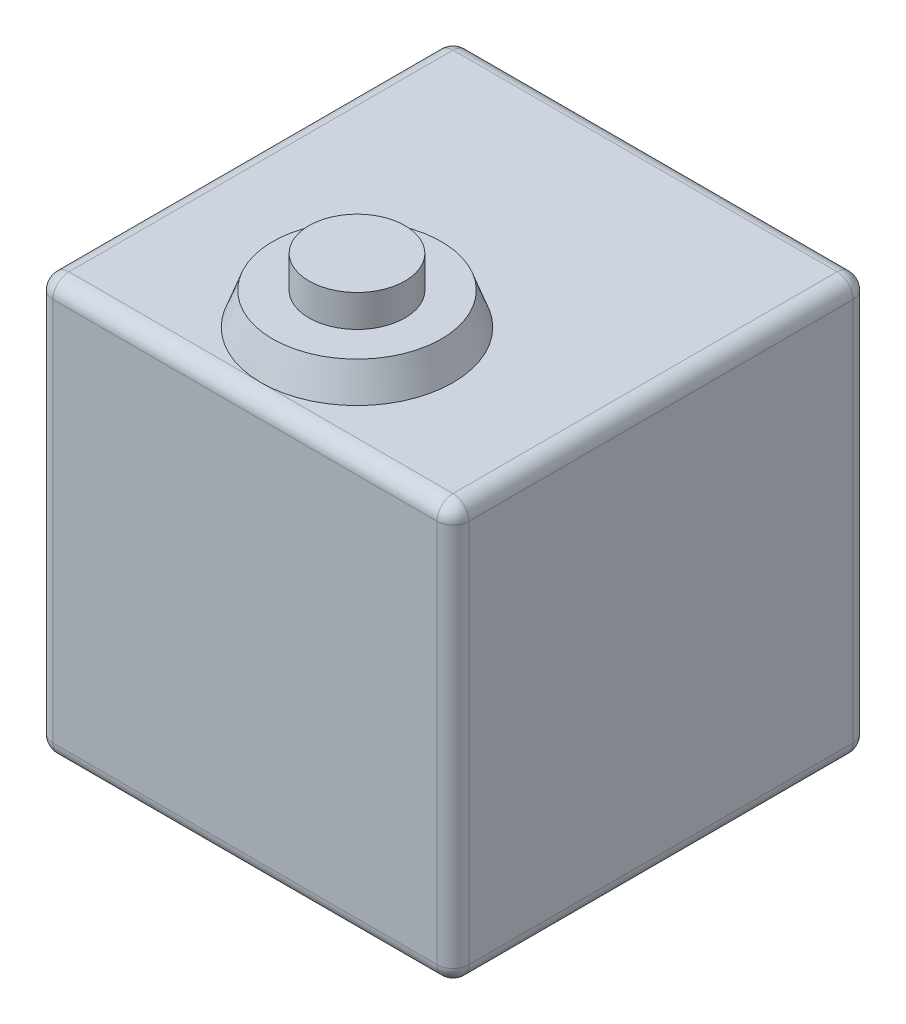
ISO-10303-21;
HEADER;
FILE_DESCRIPTION(('STEP AP214'),'2;1');
FILE_NAME('part.step','',(''),(''),'','','');
FILE_SCHEMA(('AUTOMOTIVE_DESIGN { 1 0 10303 214 1 1 1 1 }'));
ENDSEC;
DATA;
#1=APPLICATION_CONTEXT('core data for automotive mechanical design processes');
#2=APPLICATION_PROTOCOL_DEFINITION('international standard','automotive_design',2000,#1);
#3=PRODUCT_CONTEXT('',#1,'mechanical');
#4=PRODUCT('Part','Part','',(#3));
#5=PRODUCT_RELATED_PRODUCT_CATEGORY('part','',(#4));
#6=PRODUCT_DEFINITION_FORMATION('','',#4);
#7=PRODUCT_DEFINITION_CONTEXT('part definition',#1,'design');
#8=PRODUCT_DEFINITION('design','',#6,#7);
#9=PRODUCT_DEFINITION_SHAPE('','',#8);
#10=(LENGTH_UNIT() NAMED_UNIT(*) SI_UNIT(.MILLI.,.METRE.));
#11=(NAMED_UNIT(*) PLANE_ANGLE_UNIT() SI_UNIT($,.RADIAN.));
#12=(NAMED_UNIT(*) SI_UNIT($,.STERADIAN.) SOLID_ANGLE_UNIT());
#13=UNCERTAINTY_MEASURE_WITH_UNIT(LENGTH_MEASURE(1.E-05),#10,'distance_accuracy_value','');
#14=(GEOMETRIC_REPRESENTATION_CONTEXT(3) GLOBAL_UNCERTAINTY_ASSIGNED_CONTEXT((#13)) GLOBAL_UNIT_ASSIGNED_CONTEXT((#10,
#11,#12)) REPRESENTATION_CONTEXT('',''));
#15=CARTESIAN_POINT('',(0.,0.,0.));
#16=DIRECTION('',(0.,0.,1.));
#17=DIRECTION('',(1.,0.,0.));
#18=AXIS2_PLACEMENT_3D('',#15,#16,#17);
#19=CARTESIAN_POINT('',(82.55,165.1,82.55));
#20=DIRECTION('',(-1.,0.,0.));
#21=DIRECTION('',(0.,0.,1.));
#22=AXIS2_PLACEMENT_3D('',#19,#20,#21);
#23=PLANE('',#22);
#24=DIRECTION('',(0.,-1.,0.));
#25=VECTOR('',#24,1.);
#26=CARTESIAN_POINT('',(82.55,165.1,-76.2));
#27=LINE('',#26,#25);
#28=CARTESIAN_POINT('',(82.55,6.34999999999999,-76.2));
#29=VERTEX_POINT('',#28);
#30=CARTESIAN_POINT('',(82.55,158.75,-76.2));
#31=VERTEX_POINT('',#30);
#32=EDGE_CURVE('E221',#29,#31,#27,.F.);
#33=ORIENTED_EDGE('',*,*,#32,.T.);
#34=DIRECTION('',(0.,0.,-1.));
#35=VECTOR('',#34,1.);
#36=CARTESIAN_POINT('',(82.55,158.75,82.55));
#37=LINE('',#36,#35);
#38=CARTESIAN_POINT('',(82.55,158.75,76.2));
#39=VERTEX_POINT('',#38);
#40=EDGE_CURVE('E224',#31,#39,#37,.F.);
#41=ORIENTED_EDGE('',*,*,#40,.T.);
#42=DIRECTION('',(0.,-1.,0.));
#43=VECTOR('',#42,1.);
#44=CARTESIAN_POINT('',(82.55,165.1,76.2));
#45=LINE('',#44,#43);
#46=CARTESIAN_POINT('',(82.55,6.34999999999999,76.2));
#47=VERTEX_POINT('',#46);
#48=EDGE_CURVE('E215',#39,#47,#45,.T.);
#49=ORIENTED_EDGE('',*,*,#48,.T.);
#50=DIRECTION('',(0.,0.,-1.));
#51=VECTOR('',#50,1.);
#52=CARTESIAN_POINT('',(82.55,6.34999999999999,-82.55));
#53=LINE('',#52,#51);
#54=EDGE_CURVE('E218',#47,#29,#53,.T.);
#55=ORIENTED_EDGE('',*,*,#54,.T.);
#56=EDGE_LOOP('',(#33,#41,#49,#55));
#57=FACE_BOUND('',#56,.T.);
#58=ADVANCED_FACE('F47',(#57),#23,.F.);
#59=CARTESIAN_POINT('',(-82.55,165.1,-82.55));
#60=DIRECTION('',(0.,0.,1.));
#61=DIRECTION('',(1.,0.,0.));
#62=AXIS2_PLACEMENT_3D('',#59,#60,#61);
#63=PLANE('',#62);
#64=DIRECTION('',(-1.,0.,0.));
#65=VECTOR('',#64,1.);
#66=CARTESIAN_POINT('',(-82.55,6.34999999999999,-82.55));
#67=LINE('',#66,#65);
#68=CARTESIAN_POINT('',(76.2,6.34999999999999,-82.55));
#69=VERTEX_POINT('',#68);
#70=CARTESIAN_POINT('',(-76.2,6.34999999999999,-82.55));
#71=VERTEX_POINT('',#70);
#72=EDGE_CURVE('E179',#69,#71,#67,.T.);
#73=ORIENTED_EDGE('',*,*,#72,.T.);
#74=DIRECTION('',(0.,-1.,0.));
#75=VECTOR('',#74,1.);
#76=CARTESIAN_POINT('',(-76.2,165.1,-82.55));
#77=LINE('',#76,#75);
#78=CARTESIAN_POINT('',(-76.2,158.75,-82.55));
#79=VERTEX_POINT('',#78);
#80=EDGE_CURVE('E186',#71,#79,#77,.F.);
#81=ORIENTED_EDGE('',*,*,#80,.T.);
#82=DIRECTION('',(-1.,0.,0.));
#83=VECTOR('',#82,1.);
#84=CARTESIAN_POINT('',(-82.55,158.75,-82.55));
#85=LINE('',#84,#83);
#86=CARTESIAN_POINT('',(76.2,158.75,-82.55));
#87=VERTEX_POINT('',#86);
#88=EDGE_CURVE('E182',#79,#87,#85,.F.);
#89=ORIENTED_EDGE('',*,*,#88,.T.);
#90=DIRECTION('',(0.,-1.,0.));
#91=VECTOR('',#90,1.);
#92=CARTESIAN_POINT('',(76.2,165.1,-82.55));
#93=LINE('',#92,#91);
#94=EDGE_CURVE('E176',#87,#69,#93,.T.);
#95=ORIENTED_EDGE('',*,*,#94,.T.);
#96=EDGE_LOOP('',(#73,#81,#89,#95));
#97=FACE_BOUND('',#96,.T.);
#98=ADVANCED_FACE('F403',(#97),#63,.F.);
#99=CARTESIAN_POINT('',(-82.55,165.1,82.55));
#100=DIRECTION('',(1.,0.,0.));
#101=DIRECTION('',(0.,0.,-1.));
#102=AXIS2_PLACEMENT_3D('',#99,#100,#101);
#103=PLANE('',#102);
#104=DIRECTION('',(0.,0.,1.));
#105=VECTOR('',#104,1.);
#106=CARTESIAN_POINT('',(-82.55,158.75,82.55));
#107=LINE('',#106,#105);
#108=CARTESIAN_POINT('',(-82.55,158.75,76.2));
#109=VERTEX_POINT('',#108);
#110=CARTESIAN_POINT('',(-82.55,158.75,-76.2));
#111=VERTEX_POINT('',#110);
#112=EDGE_CURVE('E208',#109,#111,#107,.F.);
#113=ORIENTED_EDGE('',*,*,#112,.T.);
#114=DIRECTION('',(0.,-1.,0.));
#115=VECTOR('',#114,1.);
#116=CARTESIAN_POINT('',(-82.55,165.1,-76.2));
#117=LINE('',#116,#115);
#118=CARTESIAN_POINT('',(-82.55,6.34999999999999,-76.2));
#119=VERTEX_POINT('',#118);
#120=EDGE_CURVE('E211',#111,#119,#117,.T.);
#121=ORIENTED_EDGE('',*,*,#120,.T.);
#122=DIRECTION('',(0.,0.,1.));
#123=VECTOR('',#122,1.);
#124=CARTESIAN_POINT('',(-82.55,6.34999999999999,82.55));
#125=LINE('',#124,#123);
#126=CARTESIAN_POINT('',(-82.55,6.34999999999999,76.2));
#127=VERTEX_POINT('',#126);
#128=EDGE_CURVE('E205',#119,#127,#125,.T.);
#129=ORIENTED_EDGE('',*,*,#128,.T.);
#130=DIRECTION('',(0.,-1.,0.));
#131=VECTOR('',#130,1.);
#132=CARTESIAN_POINT('',(-82.55,165.1,76.2));
#133=LINE('',#132,#131);
#134=EDGE_CURVE('E202',#127,#109,#133,.F.);
#135=ORIENTED_EDGE('',*,*,#134,.T.);
#136=EDGE_LOOP('',(#113,#121,#129,#135));
#137=FACE_BOUND('',#136,.T.);
#138=ADVANCED_FACE('F343',(#137),#103,.F.);
#139=CARTESIAN_POINT('',(-82.55,165.1,82.55));
#140=DIRECTION('',(0.,0.,-1.));
#141=DIRECTION('',(-1.,0.,0.));
#142=AXIS2_PLACEMENT_3D('',#139,#140,#141);
#143=PLANE('',#142);
#144=DIRECTION('',(1.,0.,0.));
#145=VECTOR('',#144,1.);
#146=CARTESIAN_POINT('',(-82.55,158.75,82.55));
#147=LINE('',#146,#145);
#148=CARTESIAN_POINT('',(76.2,158.75,82.55));
#149=VERTEX_POINT('',#148);
#150=CARTESIAN_POINT('',(-76.2,158.75,82.55));
#151=VERTEX_POINT('',#150);
#152=EDGE_CURVE('E65',#149,#151,#147,.F.);
#153=ORIENTED_EDGE('',*,*,#152,.T.);
#154=DIRECTION('',(0.,-1.,0.));
#155=VECTOR('',#154,1.);
#156=CARTESIAN_POINT('',(-76.2,165.1,82.55));
#157=LINE('',#156,#155);
#158=CARTESIAN_POINT('',(-76.2,6.34999999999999,82.55));
#159=VERTEX_POINT('',#158);
#160=EDGE_CURVE('E57',#151,#159,#157,.T.);
#161=ORIENTED_EDGE('',*,*,#160,.T.);
#162=DIRECTION('',(1.,0.,0.));
#163=VECTOR('',#162,1.);
#164=CARTESIAN_POINT('',(82.55,6.34999999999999,82.55));
#165=LINE('',#164,#163);
#166=CARTESIAN_POINT('',(76.2,6.34999999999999,82.55));
#167=VERTEX_POINT('',#166);
#168=EDGE_CURVE('E228',#159,#167,#165,.T.);
#169=ORIENTED_EDGE('',*,*,#168,.T.);
#170=DIRECTION('',(0.,-1.,0.));
#171=VECTOR('',#170,1.);
#172=CARTESIAN_POINT('',(76.2,165.1,82.55));
#173=LINE('',#172,#171);
#174=EDGE_CURVE('E70',#167,#149,#173,.F.);
#175=ORIENTED_EDGE('',*,*,#174,.T.);
#176=EDGE_LOOP('',(#153,#161,#169,#175));
#177=FACE_BOUND('',#176,.T.);
#178=ADVANCED_FACE('F329',(#177),#143,.F.);
#179=CARTESIAN_POINT('',(0.,165.1,0.));
#180=DIRECTION('',(0.,-1.,0.));
#181=DIRECTION('',(0.,0.,-1.));
#182=AXIS2_PLACEMENT_3D('',#179,#180,#181);
#183=PLANE('',#182);
#184=DIRECTION('',(1.,0.,0.));
#185=VECTOR('',#184,1.);
#186=CARTESIAN_POINT('',(0.,165.1,76.2));
#187=LINE('',#186,#185);
#188=CARTESIAN_POINT('',(-76.2,165.1,76.2));
#189=VERTEX_POINT('',#188);
#190=CARTESIAN_POINT('',(0.,165.1,76.2));
#191=VERTEX_POINT('',#190);
#192=EDGE_CURVE('E141',#189,#191,#187,.T.);
#193=ORIENTED_EDGE('',*,*,#192,.T.);
#194=CARTESIAN_POINT('',(0.,165.1,38.1));
#195=DIRECTION('',(0.,1.,0.));
#196=DIRECTION('',(0.,0.,1.));
#197=AXIS2_PLACEMENT_3D('',#194,#195,#196);
#198=CIRCLE('',#197,38.1);
#199=EDGE_CURVE('E145',#191,#191,#198,.T.);
#200=ORIENTED_EDGE('',*,*,#199,.F.);
#201=CARTESIAN_POINT('',(76.2,165.1,76.2));
#202=VERTEX_POINT('',#201);
#203=EDGE_CURVE('E154',#191,#202,#187,.T.);
#204=ORIENTED_EDGE('',*,*,#203,.T.);
#205=DIRECTION('',(0.,0.,-1.));
#206=VECTOR('',#205,1.);
#207=CARTESIAN_POINT('',(76.2,165.1,0.));
#208=LINE('',#207,#206);
#209=CARTESIAN_POINT('',(76.2,165.1,-76.2));
#210=VERTEX_POINT('',#209);
#211=EDGE_CURVE('E153',#202,#210,#208,.T.);
#212=ORIENTED_EDGE('',*,*,#211,.T.);
#213=DIRECTION('',(-1.,0.,0.));
#214=VECTOR('',#213,1.);
#215=CARTESIAN_POINT('',(0.,165.1,-76.2));
#216=LINE('',#215,#214);
#217=CARTESIAN_POINT('',(-76.2,165.1,-76.2));
#218=VERTEX_POINT('',#217);
#219=EDGE_CURVE('E173',#210,#218,#216,.T.);
#220=ORIENTED_EDGE('',*,*,#219,.T.);
#221=DIRECTION('',(0.,0.,1.));
#222=VECTOR('',#221,1.);
#223=CARTESIAN_POINT('',(-76.2,165.1,0.));
#224=LINE('',#223,#222);
#225=EDGE_CURVE('E148',#218,#189,#224,.T.);
#226=ORIENTED_EDGE('',*,*,#225,.T.);
#227=EDGE_LOOP('',(#193,#200,#204,#212,#220,#226));
#228=FACE_BOUND('',#227,.T.);
#229=ADVANCED_FACE('F143',(#228),#183,.F.);
#230=CARTESIAN_POINT('',(0.,0.,0.));
#231=DIRECTION('',(0.,-1.,0.));
#232=DIRECTION('',(0.,0.,-1.));
#233=AXIS2_PLACEMENT_3D('',#230,#231,#232);
#234=PLANE('',#233);
#235=DIRECTION('',(0.,0.,1.));
#236=VECTOR('',#235,1.);
#237=CARTESIAN_POINT('',(-76.2,0.,-82.55));
#238=LINE('',#237,#236);
#239=CARTESIAN_POINT('',(-76.2,0.,76.2));
#240=VERTEX_POINT('',#239);
#241=CARTESIAN_POINT('',(-76.2,0.,-76.2));
#242=VERTEX_POINT('',#241);
#243=EDGE_CURVE('E195',#240,#242,#238,.F.);
#244=ORIENTED_EDGE('',*,*,#243,.T.);
#245=DIRECTION('',(-1.,0.,0.));
#246=VECTOR('',#245,1.);
#247=CARTESIAN_POINT('',(82.55,0.,-76.2));
#248=LINE('',#247,#246);
#249=CARTESIAN_POINT('',(76.2,0.,-76.2));
#250=VERTEX_POINT('',#249);
#251=EDGE_CURVE('E198',#242,#250,#248,.F.);
#252=ORIENTED_EDGE('',*,*,#251,.T.);
#253=DIRECTION('',(0.,0.,-1.));
#254=VECTOR('',#253,1.);
#255=CARTESIAN_POINT('',(76.2,0.,82.55));
#256=LINE('',#255,#254);
#257=CARTESIAN_POINT('',(76.2,0.,76.2));
#258=VERTEX_POINT('',#257);
#259=EDGE_CURVE('E192',#250,#258,#256,.F.);
#260=ORIENTED_EDGE('',*,*,#259,.T.);
#261=DIRECTION('',(1.,0.,0.));
#262=VECTOR('',#261,1.);
#263=CARTESIAN_POINT('',(-82.55,0.,76.2));
#264=LINE('',#263,#262);
#265=EDGE_CURVE('E189',#258,#240,#264,.F.);
#266=ORIENTED_EDGE('',*,*,#265,.T.);
#267=EDGE_LOOP('',(#244,#252,#260,#266));
#268=FACE_BOUND('',#267,.T.);
#269=ADVANCED_FACE('F359',(#268),#234,.T.);
#270=CARTESIAN_POINT('',(-82.55,6.34999999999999,76.2));
#271=DIRECTION('',(-1.,0.,0.));
#272=DIRECTION('',(0.,0.,1.));
#273=AXIS2_PLACEMENT_3D('',#270,#271,#272);
#274=CYLINDRICAL_SURFACE('',#273,6.35);
#275=CARTESIAN_POINT('',(76.2,6.34999999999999,76.2));
#276=DIRECTION('',(1.,0.,0.));
#277=DIRECTION('',(0.,0.,-1.));
#278=AXIS2_PLACEMENT_3D('',#275,#276,#277);
#279=CIRCLE('',#278,6.35);
#280=EDGE_CURVE('E51',#167,#258,#279,.T.);
#281=ORIENTED_EDGE('',*,*,#280,.F.);
#282=ORIENTED_EDGE('',*,*,#168,.F.);
#283=CARTESIAN_POINT('',(-76.2,6.35,76.2));
#284=DIRECTION('',(-1.,0.,0.));
#285=DIRECTION('',(0.,0.,1.));
#286=AXIS2_PLACEMENT_3D('',#283,#284,#285);
#287=CIRCLE('',#286,6.35);
#288=EDGE_CURVE('E164',#240,#159,#287,.T.);
#289=ORIENTED_EDGE('',*,*,#288,.F.);
#290=ORIENTED_EDGE('',*,*,#265,.F.);
#291=EDGE_LOOP('',(#281,#282,#289,#290));
#292=FACE_BOUND('',#291,.T.);
#293=ADVANCED_FACE('F49',(#292),#274,.T.);
#294=CARTESIAN_POINT('',(76.2,6.35,76.2));
#295=DIRECTION('',(0.,-1.,0.));
#296=DIRECTION('',(0.,0.,-1.));
#297=AXIS2_PLACEMENT_3D('',#294,#295,#296);
#298=SPHERICAL_SURFACE('',#297,6.35);
#299=CARTESIAN_POINT('',(76.2,6.34999999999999,76.2));
#300=DIRECTION('',(0.,-1.,0.));
#301=DIRECTION('',(0.,0.,-1.));
#302=AXIS2_PLACEMENT_3D('',#299,#300,#301);
#303=CIRCLE('',#302,6.35);
#304=EDGE_CURVE('E308',#167,#47,#303,.F.);
#305=ORIENTED_EDGE('',*,*,#304,.F.);
#306=ORIENTED_EDGE('',*,*,#280,.T.);
#307=CARTESIAN_POINT('',(76.2,6.35,76.2));
#308=DIRECTION('',(0.,0.,1.));
#309=DIRECTION('',(1.,0.,0.));
#310=AXIS2_PLACEMENT_3D('',#307,#308,#309);
#311=CIRCLE('',#310,6.35);
#312=EDGE_CURVE('E312',#47,#258,#311,.F.);
#313=ORIENTED_EDGE('',*,*,#312,.F.);
#314=EDGE_LOOP('',(#305,#306,#313));
#315=FACE_BOUND('',#314,.T.);
#316=ADVANCED_FACE('F373',(#315),#298,.T.);
#317=CARTESIAN_POINT('',(-76.2,6.35,76.2));
#318=DIRECTION('',(0.,0.,1.));
#319=DIRECTION('',(0.,-1.,0.));
#320=AXIS2_PLACEMENT_3D('',#317,#318,#319);
#321=SPHERICAL_SURFACE('',#320,6.35);
#322=CARTESIAN_POINT('',(-76.2,6.34999999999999,76.2));
#323=DIRECTION('',(0.,0.,1.));
#324=DIRECTION('',(1.,0.,0.));
#325=AXIS2_PLACEMENT_3D('',#322,#323,#324);
#326=CIRCLE('',#325,6.35);
#327=EDGE_CURVE('E301',#240,#127,#326,.F.);
#328=ORIENTED_EDGE('',*,*,#327,.F.);
#329=ORIENTED_EDGE('',*,*,#288,.T.);
#330=CARTESIAN_POINT('',(-76.2,6.34999999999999,76.2));
#331=DIRECTION('',(0.,-1.,0.));
#332=DIRECTION('',(0.,0.,-1.));
#333=AXIS2_PLACEMENT_3D('',#330,#331,#332);
#334=CIRCLE('',#333,6.35);
#335=EDGE_CURVE('E305',#127,#159,#334,.F.);
#336=ORIENTED_EDGE('',*,*,#335,.F.);
#337=EDGE_LOOP('',(#328,#329,#336));
#338=FACE_BOUND('',#337,.T.);
#339=ADVANCED_FACE('F322',(#338),#321,.T.);
#340=CARTESIAN_POINT('',(76.2,6.34999999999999,82.55));
#341=DIRECTION('',(0.,0.,1.));
#342=DIRECTION('',(1.,0.,0.));
#343=AXIS2_PLACEMENT_3D('',#340,#341,#342);
#344=CYLINDRICAL_SURFACE('',#343,6.35);
#345=ORIENTED_EDGE('',*,*,#312,.T.);
#346=ORIENTED_EDGE('',*,*,#259,.F.);
#347=CARTESIAN_POINT('',(76.2,6.34999999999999,-76.2));
#348=DIRECTION('',(0.,0.,-1.));
#349=DIRECTION('',(-1.,0.,0.));
#350=AXIS2_PLACEMENT_3D('',#347,#348,#349);
#351=CIRCLE('',#350,6.35);
#352=EDGE_CURVE('E294',#29,#250,#351,.T.);
#353=ORIENTED_EDGE('',*,*,#352,.F.);
#354=ORIENTED_EDGE('',*,*,#54,.F.);
#355=EDGE_LOOP('',(#345,#346,#353,#354));
#356=FACE_BOUND('',#355,.T.);
#357=ADVANCED_FACE('F369',(#356),#344,.T.);
#358=CARTESIAN_POINT('',(76.2,165.1,76.2));
#359=DIRECTION('',(0.,-1.,0.));
#360=DIRECTION('',(0.,0.,-1.));
#361=AXIS2_PLACEMENT_3D('',#358,#359,#360);
#362=CYLINDRICAL_SURFACE('',#361,6.35);
#363=ORIENTED_EDGE('',*,*,#304,.T.);
#364=ORIENTED_EDGE('',*,*,#48,.F.);
#365=CARTESIAN_POINT('',(76.2,158.75,76.2));
#366=DIRECTION('',(0.,1.,0.));
#367=DIRECTION('',(0.,0.,1.));
#368=AXIS2_PLACEMENT_3D('',#365,#366,#367);
#369=CIRCLE('',#368,6.35);
#370=EDGE_CURVE('E290',#149,#39,#369,.T.);
#371=ORIENTED_EDGE('',*,*,#370,.F.);
#372=ORIENTED_EDGE('',*,*,#174,.F.);
#373=EDGE_LOOP('',(#363,#364,#371,#372));
#374=FACE_BOUND('',#373,.T.);
#375=ADVANCED_FACE('F376',(#374),#362,.T.);
#376=CARTESIAN_POINT('',(0.,158.75,76.2));
#377=DIRECTION('',(1.,0.,0.));
#378=DIRECTION('',(0.,0.,-1.));
#379=AXIS2_PLACEMENT_3D('',#376,#377,#378);
#380=CYLINDRICAL_SURFACE('',#379,6.35);
#381=CARTESIAN_POINT('',(-76.2,158.75,76.2));
#382=DIRECTION('',(-1.,0.,0.));
#383=DIRECTION('',(0.,0.,1.));
#384=AXIS2_PLACEMENT_3D('',#381,#382,#383);
#385=CIRCLE('',#384,6.35);
#386=EDGE_CURVE('E285',#151,#189,#385,.T.);
#387=ORIENTED_EDGE('',*,*,#386,.F.);
#388=ORIENTED_EDGE('',*,*,#152,.F.);
#389=CARTESIAN_POINT('',(76.2,158.75,76.2));
#390=DIRECTION('',(1.,0.,0.));
#391=DIRECTION('',(0.,0.,-1.));
#392=AXIS2_PLACEMENT_3D('',#389,#390,#391);
#393=CIRCLE('',#392,6.35);
#394=EDGE_CURVE('E159',#202,#149,#393,.T.);
#395=ORIENTED_EDGE('',*,*,#394,.F.);
#396=ORIENTED_EDGE('',*,*,#203,.F.);
#397=ORIENTED_EDGE('',*,*,#192,.F.);
#398=EDGE_LOOP('',(#387,#388,#395,#396,#397));
#399=FACE_BOUND('',#398,.T.);
#400=ADVANCED_FACE('F157',(#399),#380,.T.);
#401=CARTESIAN_POINT('',(-76.2,165.1,76.2));
#402=DIRECTION('',(0.,-1.,0.));
#403=DIRECTION('',(0.,0.,-1.));
#404=AXIS2_PLACEMENT_3D('',#401,#402,#403);
#405=CYLINDRICAL_SURFACE('',#404,6.35);
#406=ORIENTED_EDGE('',*,*,#335,.T.);
#407=ORIENTED_EDGE('',*,*,#160,.F.);
#408=CARTESIAN_POINT('',(-76.2,158.75,76.2));
#409=DIRECTION('',(0.,1.,0.));
#410=DIRECTION('',(0.,0.,1.));
#411=AXIS2_PLACEMENT_3D('',#408,#409,#410);
#412=CIRCLE('',#411,6.35);
#413=EDGE_CURVE('E281',#109,#151,#412,.T.);
#414=ORIENTED_EDGE('',*,*,#413,.F.);
#415=ORIENTED_EDGE('',*,*,#134,.F.);
#416=EDGE_LOOP('',(#406,#407,#414,#415));
#417=FACE_BOUND('',#416,.T.);
#418=ADVANCED_FACE('F332',(#417),#405,.T.);
#419=CARTESIAN_POINT('',(-76.2,6.34999999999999,82.55));
#420=DIRECTION('',(0.,0.,-1.));
#421=DIRECTION('',(-1.,0.,0.));
#422=AXIS2_PLACEMENT_3D('',#419,#420,#421);
#423=CYLINDRICAL_SURFACE('',#422,6.35);
#424=ORIENTED_EDGE('',*,*,#327,.T.);
#425=ORIENTED_EDGE('',*,*,#128,.F.);
#426=CARTESIAN_POINT('',(-76.2,6.35,-76.2));
#427=DIRECTION('',(0.,0.,-1.));
#428=DIRECTION('',(-1.,0.,0.));
#429=AXIS2_PLACEMENT_3D('',#426,#427,#428);
#430=CIRCLE('',#429,6.35);
#431=EDGE_CURVE('E277',#242,#119,#430,.T.);
#432=ORIENTED_EDGE('',*,*,#431,.F.);
#433=ORIENTED_EDGE('',*,*,#243,.F.);
#434=EDGE_LOOP('',(#424,#425,#432,#433));
#435=FACE_BOUND('',#434,.T.);
#436=ADVANCED_FACE('F356',(#435),#423,.T.);
#437=CARTESIAN_POINT('',(-82.55,6.34999999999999,-76.2));
#438=DIRECTION('',(1.,0.,0.));
#439=DIRECTION('',(0.,0.,-1.));
#440=AXIS2_PLACEMENT_3D('',#437,#438,#439);
#441=CYLINDRICAL_SURFACE('',#440,6.35);
#442=CARTESIAN_POINT('',(76.2,6.35,-76.2));
#443=DIRECTION('',(1.,0.,0.));
#444=DIRECTION('',(0.,0.,-1.));
#445=AXIS2_PLACEMENT_3D('',#442,#443,#444);
#446=CIRCLE('',#445,6.35);
#447=EDGE_CURVE('E297',#250,#69,#446,.T.);
#448=ORIENTED_EDGE('',*,*,#447,.F.);
#449=ORIENTED_EDGE('',*,*,#251,.F.);
#450=CARTESIAN_POINT('',(-76.2,6.34999999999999,-76.2));
#451=DIRECTION('',(-1.,0.,0.));
#452=DIRECTION('',(0.,0.,1.));
#453=AXIS2_PLACEMENT_3D('',#450,#451,#452);
#454=CIRCLE('',#453,6.35);
#455=EDGE_CURVE('E273',#71,#242,#454,.T.);
#456=ORIENTED_EDGE('',*,*,#455,.F.);
#457=ORIENTED_EDGE('',*,*,#72,.F.);
#458=EDGE_LOOP('',(#448,#449,#456,#457));
#459=FACE_BOUND('',#458,.T.);
#460=ADVANCED_FACE('F362',(#459),#441,.T.);
#461=CARTESIAN_POINT('',(76.2,6.35,-76.2));
#462=DIRECTION('',(0.,-1.,0.));
#463=DIRECTION('',(0.,0.,-1.));
#464=AXIS2_PLACEMENT_3D('',#461,#462,#463);
#465=SPHERICAL_SURFACE('',#464,6.35);
#466=ORIENTED_EDGE('',*,*,#352,.T.);
#467=ORIENTED_EDGE('',*,*,#447,.T.);
#468=CARTESIAN_POINT('',(76.2,6.34999999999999,-76.2));
#469=DIRECTION('',(0.,-1.,0.));
#470=DIRECTION('',(0.,0.,-1.));
#471=AXIS2_PLACEMENT_3D('',#468,#469,#470);
#472=CIRCLE('',#471,6.35);
#473=EDGE_CURVE('E269',#29,#69,#472,.F.);
#474=ORIENTED_EDGE('',*,*,#473,.F.);
#475=EDGE_LOOP('',(#466,#467,#474));
#476=FACE_BOUND('',#475,.T.);
#477=ADVANCED_FACE('F555',(#476),#465,.T.);
#478=CARTESIAN_POINT('',(76.2,158.75,76.2));
#479=DIRECTION('',(0.,0.,1.));
#480=DIRECTION('',(1.,0.,0.));
#481=AXIS2_PLACEMENT_3D('',#478,#479,#480);
#482=SPHERICAL_SURFACE('',#481,6.35);
#483=ORIENTED_EDGE('',*,*,#394,.T.);
#484=ORIENTED_EDGE('',*,*,#370,.T.);
#485=CARTESIAN_POINT('',(76.2,158.75,76.2));
#486=DIRECTION('',(0.,0.,1.));
#487=DIRECTION('',(1.,0.,0.));
#488=AXIS2_PLACEMENT_3D('',#485,#486,#487);
#489=CIRCLE('',#488,6.35);
#490=EDGE_CURVE('E266',#202,#39,#489,.F.);
#491=ORIENTED_EDGE('',*,*,#490,.F.);
#492=EDGE_LOOP('',(#483,#484,#491));
#493=FACE_BOUND('',#492,.T.);
#494=ADVANCED_FACE('F378',(#493),#482,.T.);
#495=CARTESIAN_POINT('',(-76.2,158.75,76.2));
#496=DIRECTION('',(0.,0.,1.));
#497=DIRECTION('',(1.,0.,0.));
#498=AXIS2_PLACEMENT_3D('',#495,#496,#497);
#499=SPHERICAL_SURFACE('',#498,6.35);
#500=ORIENTED_EDGE('',*,*,#413,.T.);
#501=ORIENTED_EDGE('',*,*,#386,.T.);
#502=CARTESIAN_POINT('',(-76.2,158.75,76.2));
#503=DIRECTION('',(0.,0.,1.));
#504=DIRECTION('',(1.,0.,0.));
#505=AXIS2_PLACEMENT_3D('',#502,#503,#504);
#506=CIRCLE('',#505,6.35);
#507=EDGE_CURVE('E262',#109,#189,#506,.F.);
#508=ORIENTED_EDGE('',*,*,#507,.F.);
#509=EDGE_LOOP('',(#500,#501,#508));
#510=FACE_BOUND('',#509,.T.);
#511=ADVANCED_FACE('F336',(#510),#499,.T.);
#512=CARTESIAN_POINT('',(-76.2,6.35,-76.2));
#513=DIRECTION('',(0.,-1.,0.));
#514=DIRECTION('',(0.,0.,-1.));
#515=AXIS2_PLACEMENT_3D('',#512,#513,#514);
#516=SPHERICAL_SURFACE('',#515,6.35);
#517=ORIENTED_EDGE('',*,*,#455,.T.);
#518=ORIENTED_EDGE('',*,*,#431,.T.);
#519=CARTESIAN_POINT('',(-76.2,6.34999999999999,-76.2));
#520=DIRECTION('',(0.,-1.,0.));
#521=DIRECTION('',(0.,0.,-1.));
#522=AXIS2_PLACEMENT_3D('',#519,#520,#521);
#523=CIRCLE('',#522,6.35);
#524=EDGE_CURVE('E259',#71,#119,#523,.F.);
#525=ORIENTED_EDGE('',*,*,#524,.F.);
#526=EDGE_LOOP('',(#517,#518,#525));
#527=FACE_BOUND('',#526,.T.);
#528=ADVANCED_FACE('F353',(#527),#516,.T.);
#529=CARTESIAN_POINT('',(76.2,165.1,-76.2));
#530=DIRECTION('',(0.,-1.,0.));
#531=DIRECTION('',(0.,0.,-1.));
#532=AXIS2_PLACEMENT_3D('',#529,#530,#531);
#533=CYLINDRICAL_SURFACE('',#532,6.35);
#534=ORIENTED_EDGE('',*,*,#473,.T.);
#535=ORIENTED_EDGE('',*,*,#94,.F.);
#536=CARTESIAN_POINT('',(76.2,158.75,-76.2));
#537=DIRECTION('',(0.,1.,0.));
#538=DIRECTION('',(0.,0.,1.));
#539=AXIS2_PLACEMENT_3D('',#536,#537,#538);
#540=CIRCLE('',#539,6.35);
#541=EDGE_CURVE('E255',#31,#87,#540,.T.);
#542=ORIENTED_EDGE('',*,*,#541,.F.);
#543=ORIENTED_EDGE('',*,*,#32,.F.);
#544=EDGE_LOOP('',(#534,#535,#542,#543));
#545=FACE_BOUND('',#544,.T.);
#546=ADVANCED_FACE('F521',(#545),#533,.T.);
#547=CARTESIAN_POINT('',(76.2,158.75,0.));
#548=DIRECTION('',(0.,0.,-1.));
#549=DIRECTION('',(-1.,0.,0.));
#550=AXIS2_PLACEMENT_3D('',#547,#548,#549);
#551=CYLINDRICAL_SURFACE('',#550,6.35);
#552=ORIENTED_EDGE('',*,*,#490,.T.);
#553=ORIENTED_EDGE('',*,*,#40,.F.);
#554=CARTESIAN_POINT('',(76.2,158.75,-76.2));
#555=DIRECTION('',(0.,0.,-1.));
#556=DIRECTION('',(-1.,0.,0.));
#557=AXIS2_PLACEMENT_3D('',#554,#555,#556);
#558=CIRCLE('',#557,6.35);
#559=EDGE_CURVE('E251',#210,#31,#558,.T.);
#560=ORIENTED_EDGE('',*,*,#559,.F.);
#561=ORIENTED_EDGE('',*,*,#211,.F.);
#562=EDGE_LOOP('',(#552,#553,#560,#561));
#563=FACE_BOUND('',#562,.T.);
#564=ADVANCED_FACE('F383',(#563),#551,.T.);
#565=CARTESIAN_POINT('',(-76.2,158.75,0.));
#566=DIRECTION('',(0.,0.,1.));
#567=DIRECTION('',(1.,0.,0.));
#568=AXIS2_PLACEMENT_3D('',#565,#566,#567);
#569=CYLINDRICAL_SURFACE('',#568,6.35);
#570=ORIENTED_EDGE('',*,*,#507,.T.);
#571=ORIENTED_EDGE('',*,*,#225,.F.);
#572=CARTESIAN_POINT('',(-76.2,158.75,-76.2));
#573=DIRECTION('',(0.,0.,-1.));
#574=DIRECTION('',(-1.,0.,0.));
#575=AXIS2_PLACEMENT_3D('',#572,#573,#574);
#576=CIRCLE('',#575,6.35);
#577=EDGE_CURVE('E247',#111,#218,#576,.T.);
#578=ORIENTED_EDGE('',*,*,#577,.F.);
#579=ORIENTED_EDGE('',*,*,#112,.F.);
#580=EDGE_LOOP('',(#570,#571,#578,#579));
#581=FACE_BOUND('',#580,.T.);
#582=ADVANCED_FACE('F340',(#581),#569,.T.);
#583=CARTESIAN_POINT('',(-76.2,165.1,-76.2));
#584=DIRECTION('',(0.,-1.,0.));
#585=DIRECTION('',(0.,0.,-1.));
#586=AXIS2_PLACEMENT_3D('',#583,#584,#585);
#587=CYLINDRICAL_SURFACE('',#586,6.35);
#588=ORIENTED_EDGE('',*,*,#524,.T.);
#589=ORIENTED_EDGE('',*,*,#120,.F.);
#590=CARTESIAN_POINT('',(-76.2,158.75,-76.2));
#591=DIRECTION('',(0.,1.,0.));
#592=DIRECTION('',(0.,0.,1.));
#593=AXIS2_PLACEMENT_3D('',#590,#591,#592);
#594=CIRCLE('',#593,6.35);
#595=EDGE_CURVE('E243',#79,#111,#594,.T.);
#596=ORIENTED_EDGE('',*,*,#595,.F.);
#597=ORIENTED_EDGE('',*,*,#80,.F.);
#598=EDGE_LOOP('',(#588,#589,#596,#597));
#599=FACE_BOUND('',#598,.T.);
#600=ADVANCED_FACE('F346',(#599),#587,.T.);
#601=CARTESIAN_POINT('',(76.2,158.75,-76.2));
#602=DIRECTION('',(1.,0.,0.));
#603=DIRECTION('',(0.,0.,-1.));
#604=AXIS2_PLACEMENT_3D('',#601,#602,#603);
#605=SPHERICAL_SURFACE('',#604,6.35);
#606=ORIENTED_EDGE('',*,*,#559,.T.);
#607=ORIENTED_EDGE('',*,*,#541,.T.);
#608=CARTESIAN_POINT('',(76.2,158.75,-76.2));
#609=DIRECTION('',(1.,0.,0.));
#610=DIRECTION('',(0.,0.,-1.));
#611=AXIS2_PLACEMENT_3D('',#608,#609,#610);
#612=CIRCLE('',#611,6.35);
#613=EDGE_CURVE('E240',#210,#87,#612,.F.);
#614=ORIENTED_EDGE('',*,*,#613,.F.);
#615=EDGE_LOOP('',(#606,#607,#614));
#616=FACE_BOUND('',#615,.T.);
#617=ADVANCED_FACE('F392',(#616),#605,.T.);
#618=CARTESIAN_POINT('',(-76.2,158.75,-76.2));
#619=DIRECTION('',(-1.,0.,0.));
#620=DIRECTION('',(0.,0.,1.));
#621=AXIS2_PLACEMENT_3D('',#618,#619,#620);
#622=SPHERICAL_SURFACE('',#621,6.35);
#623=ORIENTED_EDGE('',*,*,#595,.T.);
#624=ORIENTED_EDGE('',*,*,#577,.T.);
#625=CARTESIAN_POINT('',(-76.2,158.75,-76.2));
#626=DIRECTION('',(-1.,0.,0.));
#627=DIRECTION('',(0.,0.,1.));
#628=AXIS2_PLACEMENT_3D('',#625,#626,#627);
#629=CIRCLE('',#628,6.35);
#630=EDGE_CURVE('E237',#79,#218,#629,.F.);
#631=ORIENTED_EDGE('',*,*,#630,.F.);
#632=EDGE_LOOP('',(#623,#624,#631));
#633=FACE_BOUND('',#632,.T.);
#634=ADVANCED_FACE('F390',(#633),#622,.T.);
#635=CARTESIAN_POINT('',(0.,158.75,-76.2));
#636=DIRECTION('',(-1.,0.,0.));
#637=DIRECTION('',(0.,0.,1.));
#638=AXIS2_PLACEMENT_3D('',#635,#636,#637);
#639=CYLINDRICAL_SURFACE('',#638,6.35);
#640=ORIENTED_EDGE('',*,*,#613,.T.);
#641=ORIENTED_EDGE('',*,*,#88,.F.);
#642=ORIENTED_EDGE('',*,*,#630,.T.);
#643=ORIENTED_EDGE('',*,*,#219,.F.);
#644=EDGE_LOOP('',(#640,#641,#642,#643));
#645=FACE_BOUND('',#644,.T.);
#646=ADVANCED_FACE('F387',(#645),#639,.T.);
#647=CARTESIAN_POINT('',(0.,165.1,38.1));
#648=DIRECTION('',(0.,-1.,0.));
#649=DIRECTION('',(0.,0.,1.));
#650=AXIS2_PLACEMENT_3D('',#647,#648,#649);
#651=CONICAL_SURFACE('',#650,38.1,0.349065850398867);
#652=CARTESIAN_POINT('',(0.,177.8,38.1));
#653=DIRECTION('',(0.,1.,0.));
#654=DIRECTION('',(0.,0.,1.));
#655=AXIS2_PLACEMENT_3D('',#652,#653,#654);
#656=CIRCLE('',#655,33.4775780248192);
#657=CARTESIAN_POINT('',(0.,177.8,71.5775780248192));
#658=VERTEX_POINT('',#657);
#659=EDGE_CURVE('E167',#658,#658,#656,.T.);
#660=ORIENTED_EDGE('',*,*,#659,.F.);
#661=EDGE_LOOP('',(#660));
#662=FACE_BOUND('',#661,.T.);
#663=ORIENTED_EDGE('',*,*,#199,.T.);
#664=EDGE_LOOP('',(#663));
#665=FACE_BOUND('',#664,.T.);
#666=ADVANCED_FACE('F398',(#662,#665),#651,.T.);
#667=CARTESIAN_POINT('',(0.,177.8,38.1));
#668=DIRECTION('',(0.,1.,0.));
#669=DIRECTION('',(0.,0.,1.));
#670=AXIS2_PLACEMENT_3D('',#667,#668,#669);
#671=PLANE('',#670);
#672=CARTESIAN_POINT('',(0.,177.8,38.1));
#673=DIRECTION('',(0.,1.,0.));
#674=DIRECTION('',(0.,0.,1.));
#675=AXIS2_PLACEMENT_3D('',#672,#673,#674);
#676=CIRCLE('',#675,19.05);
#677=CARTESIAN_POINT('',(0.,177.8,57.15));
#678=VERTEX_POINT('',#677);
#679=EDGE_CURVE('E11',#678,#678,#676,.T.);
#680=ORIENTED_EDGE('',*,*,#679,.F.);
#681=EDGE_LOOP('',(#680));
#682=FACE_BOUND('',#681,.T.);
#683=ORIENTED_EDGE('',*,*,#659,.T.);
#684=EDGE_LOOP('',(#683));
#685=FACE_BOUND('',#684,.T.);
#686=ADVANCED_FACE('F422',(#682,#685),#671,.T.);
#687=CARTESIAN_POINT('',(0.,190.5,38.1));
#688=DIRECTION('',(0.,-1.,0.));
#689=DIRECTION('',(0.,0.,-1.));
#690=AXIS2_PLACEMENT_3D('',#687,#688,#689);
#691=CYLINDRICAL_SURFACE('',#690,19.05);
#692=CARTESIAN_POINT('',(0.,190.5,38.1));
#693=DIRECTION('',(0.,1.,0.));
#694=DIRECTION('',(0.,0.,1.));
#695=AXIS2_PLACEMENT_3D('',#692,#693,#694);
#696=CIRCLE('',#695,19.05);
#697=CARTESIAN_POINT('',(0.,190.5,57.15));
#698=VERTEX_POINT('',#697);
#699=EDGE_CURVE('E438',#698,#698,#696,.T.);
#700=ORIENTED_EDGE('',*,*,#699,.F.);
#701=EDGE_LOOP('',(#700));
#702=FACE_BOUND('',#701,.T.);
#703=ORIENTED_EDGE('',*,*,#679,.T.);
#704=EDGE_LOOP('',(#703));
#705=FACE_BOUND('',#704,.T.);
#706=ADVANCED_FACE('F426',(#702,#705),#691,.T.);
#707=CARTESIAN_POINT('',(0.,190.5,38.1));
#708=DIRECTION('',(0.,1.,0.));
#709=DIRECTION('',(0.,0.,1.));
#710=AXIS2_PLACEMENT_3D('',#707,#708,#709);
#711=PLANE('',#710);
#712=ORIENTED_EDGE('',*,*,#699,.T.);
#713=EDGE_LOOP('',(#712));
#714=FACE_BOUND('',#713,.T.);
#715=ADVANCED_FACE('F430',(#714),#711,.T.);
#716=CLOSED_SHELL('',(#58,#98,#138,#178,#229,#269,#293,#316,#339,#357,#375,#400,#418,#436,#460,
#477,#494,#511,#528,#546,#564,#582,#600,#617,#634,#646,#666,#686,#706,#715));
#717=MANIFOLD_SOLID_BREP('B2',#716);
#718=ADVANCED_BREP_SHAPE_REPRESENTATION('',(#18,#717),#14);
#719=SHAPE_DEFINITION_REPRESENTATION(#9,#718);
ENDSEC;
END-ISO-10303-21;
